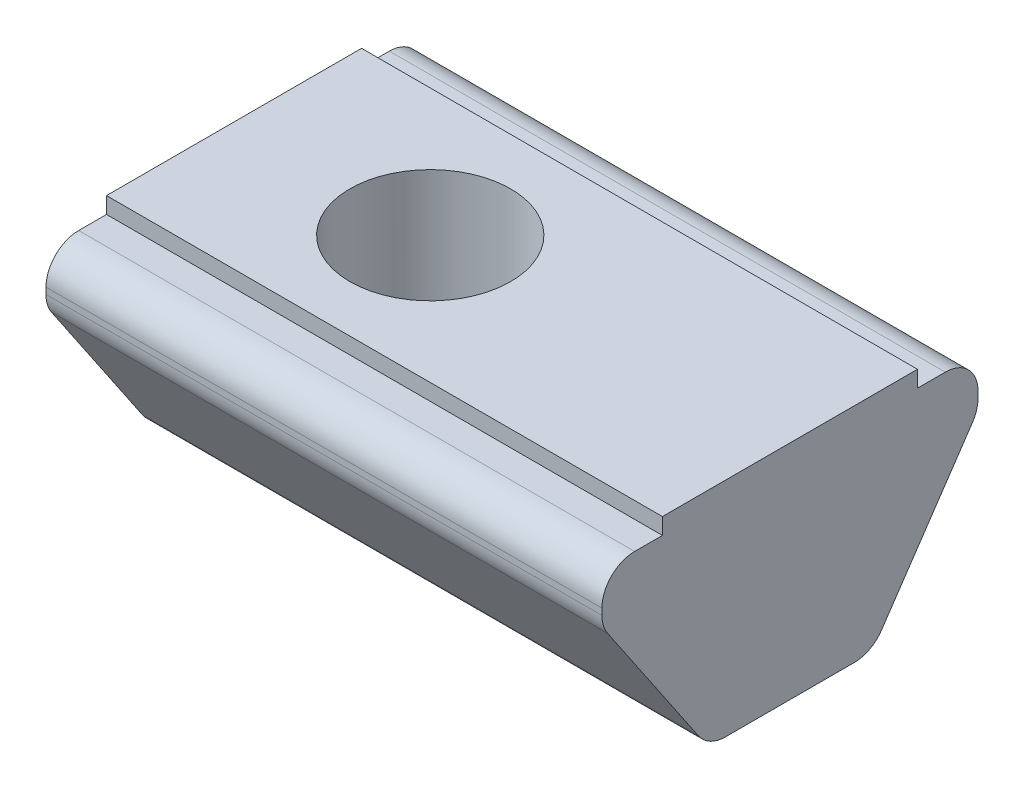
from build123d import *

# Parameters (mm, degrees)
BOSS_EXTRUDE1_DEPTH = 17
FILLET1_R           = 1
SKETCH2_W           = 2.35
SKETCH2_H           = 0.2
TAPPED_HOLE1_D      = 4.917


with BuildPart() as part:
    # Sketch1 → Boss-Extrude1 (new body)
    with BuildSketch(Plane(origin=(-6, 0, 0), x_dir=(0, 0, -1), z_dir=(1, 0, 0))):
        Polygon((3.9, 0), (-3.9, 0), (-3.9, -0.5), (-5.75, -0.5), (-5.75, -2), (-2.5, -6.8), (2.5, -6.8), (5.75, -2), (5.75, -0.5), (3.9, -0.5), align=None)
    extrude(amount=BOSS_EXTRUDE1_DEPTH)

    # Fillet1
    fillet1_edges = [part.edges().sort_by_distance(p)[0] for p in [
        (2.5, -0.5, 5.75),
        (2.5, -0.5, -5.75),
        (2.5, -2, -5.75),
        (2.5, -6.8, -2.5),
        (2.5, -6.8, 2.5),
        (2.5, -2, 5.75),
    ]]
    fillet(fillet1_edges, radius=FILLET1_R)

    # Sketch2 → Cut-Revolve1 (revolve, cut)
    with BuildSketch(Plane(origin=(7.5, 0, 0), x_dir=(0, 0, -1), z_dir=(1, 0, 0)), mode=Mode.PRIVATE) as cut_revolve1_sk:
        with Locations((1.175, -6.7)):
            Rectangle(SKETCH2_W, SKETCH2_H)
    revolve(cut_revolve1_sk.sketch.rotate(Axis((7.5, 1.665548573, 0), (0, -1, 0)), 180), axis=Axis((7.5, 1.665548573, 0), (0, -1, 0)), mode=Mode.SUBTRACT)

    # Sketch3 → Revolve1 (revolve)
    with BuildSketch(Plane(origin=(7.5, 0, 0), x_dir=(0, 0, -1), z_dir=(1, 0, 0)), mode=Mode.PRIVATE) as revolve1_sk:
        with BuildLine():
            Line((1.989974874, -6.6), (0, -6.6))
            Line((0, -6.6), (0, -7.8))
            ThreePointArc((0, -7.8), (1.161895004, -7.476784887), (1.989974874, -6.6))
        make_face()
    revolve(revolve1_sk.sketch.rotate(Axis((7.5, 0, 0), (0, -1, 0)), 180), axis=Axis((7.5, 0, 0), (0, -1, 0)))

    # Tapped Hole1 (through all)
    with Locations(Plane(origin=(0, 0, 0), x_dir=(1, 0, 0), z_dir=(0, 1, 0))):
        with Locations((0, 0)):
            Hole(TAPPED_HOLE1_D / 2)


solid = part.part
